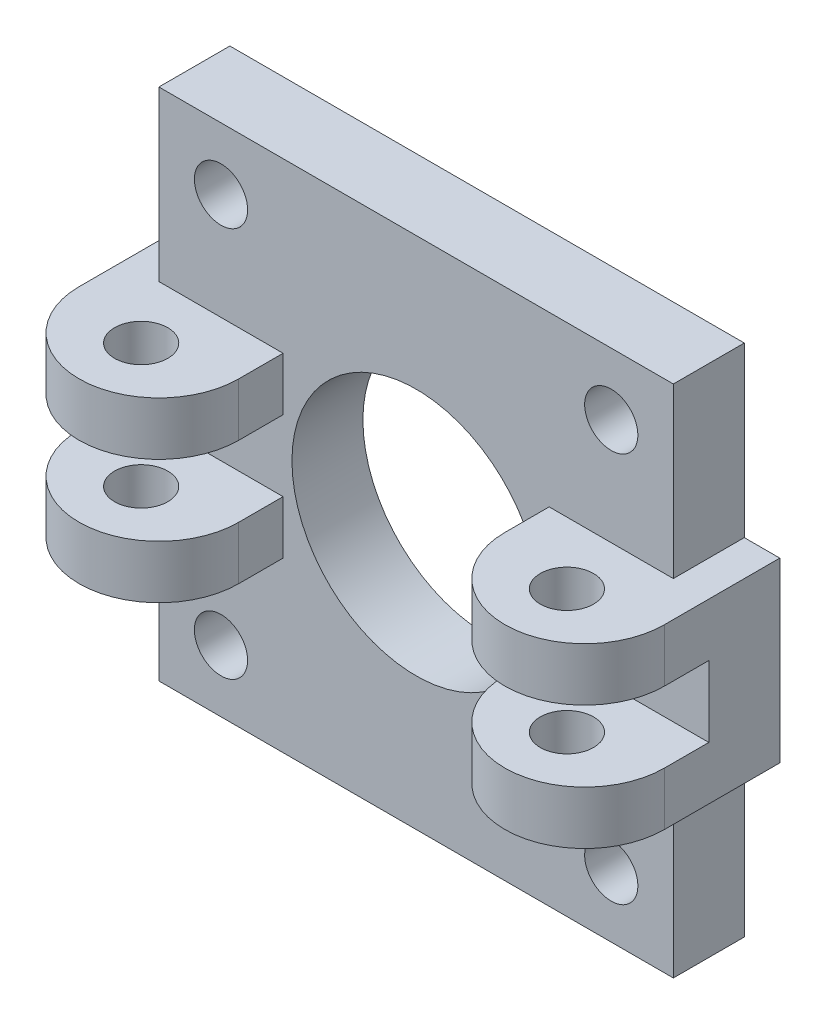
from build123d import *

# Parameters (mm, degrees)
SKETCH_1_W                  = 29
SKETCH_1_H                  = 29
SKETCH_1_R                  = 9.5
SKETCH_1_R_2                = 7
EXTRUDE_2_DEPTH             = 4
SKETCH_3_R                  = 1.5
CUT_EXTRUDE_1_DEPTH         = 5
SKETCH_4_W                  = 9
SKETCH_4_H                  = 10
EXTRUDE_3_DEPTH             = 7
EXTRUDE_3_DIRECTION_2_REACH = 31.908
SKETCH_5_W                  = 9
SKETCH_5_H                  = 4
CUT_EXTRUDE_2_DEPTH         = 7
CUT_EXTRUDE_3_REACH         = 34.912
SKETCH_6_R                  = 1.5


with BuildPart() as part:
    # Sketch 1 → Extrude 2 (new body)
    # profile 1 of 2: a face of its own
    with BuildSketch(Plane.XY):
        with Locations((-7.623161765, -5.224264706)):
            Rectangle(SKETCH_1_W, SKETCH_1_H)
        with Locations((-7.623161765, -5.224264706)):
            Circle(SKETCH_1_R, mode=Mode.SUBTRACT)
    # profile 2 of 2: a face of its own
    with BuildSketch(Plane.XY):
        with Locations((-7.623161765, -5.224264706)):
            Circle(SKETCH_1_R)
        with Locations((-7.623161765, -5.224264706)):
            Circle(SKETCH_1_R_2, mode=Mode.SUBTRACT)
    extrude(amount=EXTRUDE_2_DEPTH)

    # Sketch 3 → Cut-Extrude 1 (cut)
    with BuildSketch(Plane.XY.offset(4)):
        with Locations((-18.623161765, 5.775735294)):
            Circle(SKETCH_3_R)
        with Locations((3.376838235, 5.775735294)):
            Circle(SKETCH_3_R)
        with Locations((3.376838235, -16.224264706)):
            Circle(SKETCH_3_R)
        with Locations((-18.623161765, -16.224264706)):
            Circle(SKETCH_3_R)
    extrude(amount=-CUT_EXTRUDE_1_DEPTH, mode=Mode.SUBTRACT)

    # Sketch 4 → Extrude 3 (add)
    with BuildSketch(Plane.XY.offset(4)):
        with Locations((-19.623161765, -5.224264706)):
            Rectangle(SKETCH_4_W, SKETCH_4_H)
    extrude_3 = extrude(amount=EXTRUDE_3_DEPTH)

    # Extrude 3 direction 2: up to this face of the body (flat: up to its plane)
    extrude_3_direction_2_end = Plane(part.part.faces().sort_by_distance((6.466716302, -5.224264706, 0))[0])
    # Sketch 4 → Extrude 3 direction 2 (add, up to the picked face)
    with BuildSketch(Plane.XY.offset(4), mode=Mode.PRIVATE) as extrude_3_direction_2_sk1:
        with Locations((-19.623161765, -5.224264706)):
            Rectangle(SKETCH_4_W, SKETCH_4_H)
    extrude_3_direction_2_tool1 = split(extrude(extrude_3_direction_2_sk1.sketch, amount=-EXTRUDE_3_DIRECTION_2_REACH, mode=Mode.PRIVATE), bisect_by=extrude_3_direction_2_end, keep=Keep.BOTH, mode=Mode.PRIVATE)
    extrude_3_direction_2 = extrude_3_direction_2_tool1.solids().sort_by(Axis((-19.623162, -5.224265, 4), (0, 0, -1)))[0]
    add(extrude_3_direction_2)

    # Sketch 5 → Cut-Extrude 2 (cut)
    with BuildSketch(Plane.XY.offset(11)):
        with Locations((-19.623161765, -5.224264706)):
            Rectangle(SKETCH_5_W, SKETCH_5_H)
    cut_extrude_2 = extrude(amount=-CUT_EXTRUDE_2_DEPTH, mode=Mode.SUBTRACT)

    # Cut-Extrude 3: up to this face of the body (flat: up to its plane)
    cut_extrude_3_end = Plane(part.part.faces().sort_by_distance((-20.017527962, -10.224264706, 6.88028169))[0])
    # Sketch 6 → Cut-Extrude 3 (cut, up to the picked face)
    with BuildSketch(Plane(origin=(0, -0.224264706, 0), x_dir=(1, 0, 0), z_dir=(0, 1, 0)), mode=Mode.PRIVATE) as cut_extrude_3_sk1:
        with Locations(Location((-19.623161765, -7.5, 0), (0, 0, 180))):
            Circle(SKETCH_6_R)
    cut_extrude_3_tool1 = split(extrude(cut_extrude_3_sk1.sketch, amount=-CUT_EXTRUDE_3_REACH, mode=Mode.PRIVATE), bisect_by=cut_extrude_3_end, keep=Keep.BOTH, mode=Mode.PRIVATE)
    # Sketch 6 → Cut-Extrude 3 (cut, up to the picked face)
    with BuildSketch(Plane(origin=(0, -0.224264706, 0), x_dir=(1, 0, 0), z_dir=(0, 1, 0)), mode=Mode.PRIVATE) as cut_extrude_3_sk2:
        with BuildLine():
            Line((-24.123161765, -11), (-19.623161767, -11))
            ThreePointArc((-19.623161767, -11), (-22.805142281, -9.681980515), (-24.123161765, -6.5))
            Line((-24.123161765, -6.5), (-24.123161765, -11))
        make_face()
    cut_extrude_3_tool2 = split(extrude(cut_extrude_3_sk2.sketch, amount=-CUT_EXTRUDE_3_REACH, mode=Mode.PRIVATE), bisect_by=cut_extrude_3_end, keep=Keep.BOTH, mode=Mode.PRIVATE)
    # Sketch 6 → Cut-Extrude 3 (cut, up to the picked face)
    with BuildSketch(Plane(origin=(0, -0.224264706, 0), x_dir=(1, 0, 0), z_dir=(0, 1, 0)), mode=Mode.PRIVATE) as cut_extrude_3_sk3:
        with BuildLine():
            Line((-15.123161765, -11), (-15.123161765, -6.5))
            ThreePointArc((-15.123161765, -6.5), (-16.44118125, -9.681980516), (-19.623161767, -11))
            Line((-19.623161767, -11), (-15.123161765, -11))
        make_face()
    cut_extrude_3_tool3 = split(extrude(cut_extrude_3_sk3.sketch, amount=-CUT_EXTRUDE_3_REACH, mode=Mode.PRIVATE), bisect_by=cut_extrude_3_end, keep=Keep.BOTH, mode=Mode.PRIVATE)
    cut_extrude_3_1 = cut_extrude_3_tool1.solids().sort_by(Axis((-19.623162, -0.224265, 7.5), (0, -1, 0)))[0]
    add(cut_extrude_3_1, mode=Mode.SUBTRACT)
    cut_extrude_3_2 = cut_extrude_3_tool2.solids().sort_by(Axis((-23.118006, -0.224265, 9.994844), (0, -1, 0)))[0]
    add(cut_extrude_3_2, mode=Mode.SUBTRACT)
    cut_extrude_3_3 = cut_extrude_3_tool3.solids().sort_by(Axis((-16.128317, -0.224265, 9.994844), (0, -1, 0)))[0]
    add(cut_extrude_3_3, mode=Mode.SUBTRACT)
    cut_extrude_3 = cut_extrude_3_1 + cut_extrude_3_2 + cut_extrude_3_3  # Cut-Extrude 3 as one shape, for the pattern or mirror that repeats it

    # Mirror 1: Extrude 3, Extrude 3 direction 2, Cut-Extrude 2, Cut-Extrude 3 across plane
    add(extrude_3.mirror(Plane.ZY.offset(7.623161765)))
    add(extrude_3_direction_2.mirror(Plane.ZY.offset(7.623161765)))
    add(cut_extrude_2.mirror(Plane.ZY.offset(7.623161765)), mode=Mode.SUBTRACT)
    add(cut_extrude_3.mirror(Plane.ZY.offset(7.623161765)), mode=Mode.SUBTRACT)


solid = part.part
